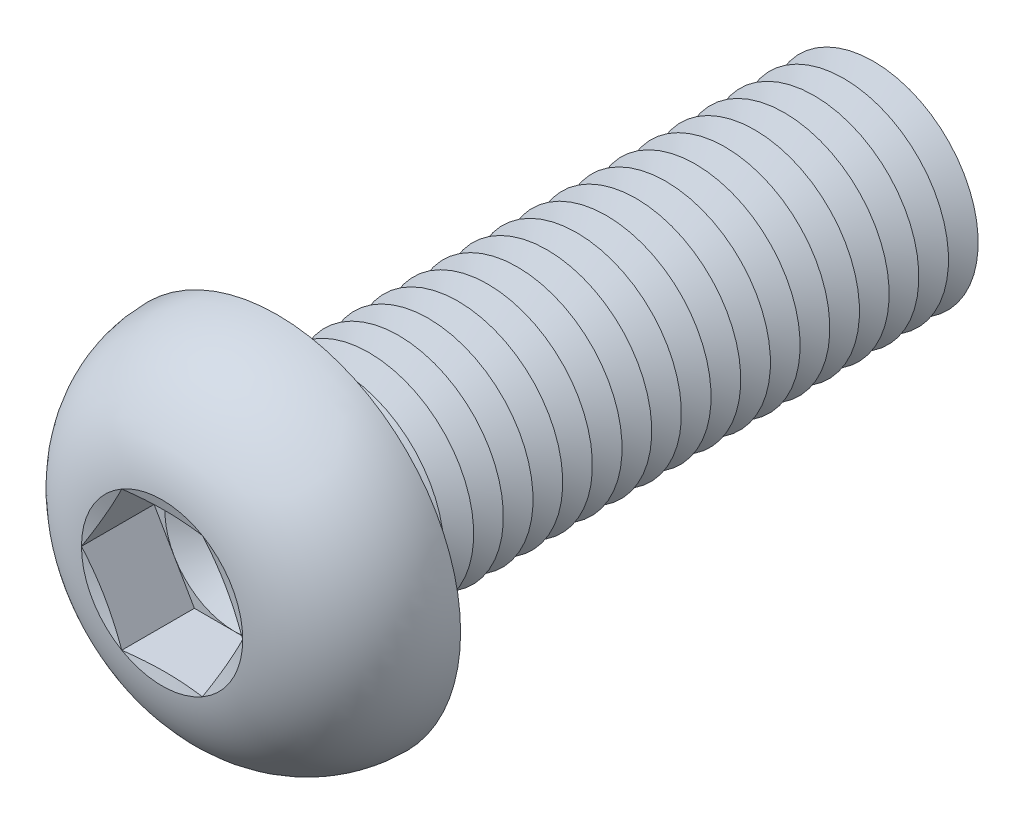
from build123d import *

# Parameters (mm, degrees)
FILLET1_R          = 0.85
LPATTERN1_COUNT    = 20
LPATTERN1_PITCH    = 1.7
CUT_EXTRUDE1_DEPTH = 4.16


with BuildPart() as part:
    # Sketch1 → Revolve1 (revolve)
    with BuildSketch(Plane(origin=(0, 0, 0), x_dir=(0, 0, -1), z_dir=(1, 0, 0))):
        with BuildLine():
            Line((0, 6), (0, 10.5))
            ThreePointArc((0, 10.5), (-4.420082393, 8.816378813), (-6.6, 4.6188))
            Line((-6.6, 4.6188), (-5.981198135, 2.3094))
            Line((-5.981198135, 2.3094), (-6.6, 2.3094))
            Line((-6.6, 2.3094), (-6.6, 0))
            Line((-6.6, 0), (35, 0))
            Line((35, 0), (35, 6))
            Line((35, 6), (0, 6))
        make_face()
    revolve(axis=Axis((0, 0, -35), (0, 0, 1)))

    # Fillet1
    fillet1_edges = [part.edges().sort_by_distance(p)[0] for p in [
        (0, -6, 0),
    ]]
    fillet(fillet1_edges, radius=FILLET1_R)

    # Sketch2 → Cut-Revolve1 (revolve, cut)
    with BuildSketch(Plane(origin=(0, 0, 0), x_dir=(0, 0, -1), z_dir=(1, 0, 0))):
        Polygon((34.15, 6), (35.85, 6), (35, 4.527756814), align=None)
    cut_revolve1 = revolve(axis=Axis((0, 0, -35), (0, 0, -1)), mode=Mode.SUBTRACT)

    # LPattern1: Cut-Revolve1 ×20
    with Locations(*[(0, 0, i * LPATTERN1_PITCH) for i in range(1, LPATTERN1_COUNT)]):
        add(cut_revolve1, mode=Mode.SUBTRACT)

    # Sketch3 → Cut-Extrude1 (cut)
    with BuildSketch(Plane.XY.offset(6.6)):
        Polygon((2.3094, 3.999998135), (-2.3094, 3.999998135), (-4.6188, 0), (-2.3094, -3.999998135), (2.3094, -3.999998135), (4.6188, 0), align=None)
    extrude(amount=-CUT_EXTRUDE1_DEPTH, mode=Mode.SUBTRACT)

    # Cut-Extrude2 cone 1 section (on through the dimple's axis) → Cut-Extrude2 (revolve, cut)
    with BuildSketch(Plane(origin=(0, 0, 2.44), x_dir=(0, -1, 0), z_dir=(1, 0, 0))):
        Polygon((0, 0), (3.999998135, 0), (0, 2.3094), align=None)
    revolve(axis=Axis((0, 0, 2.44), (0, 0, -1)), mode=Mode.SUBTRACT)


solid = part.part
